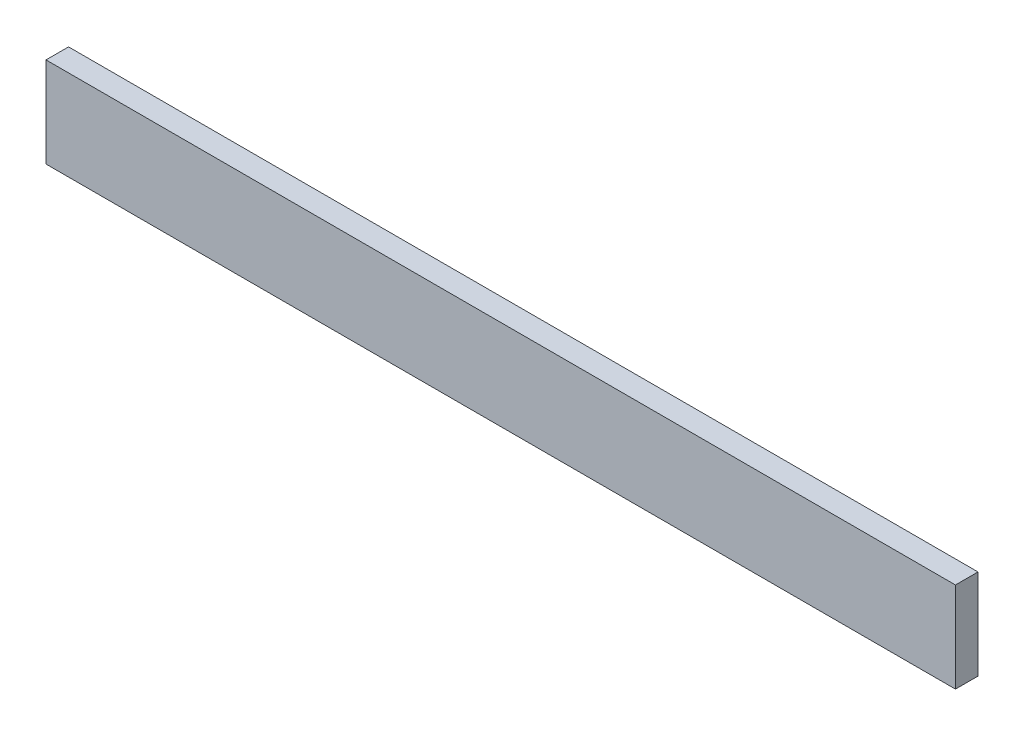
ISO-10303-21;
HEADER;
FILE_DESCRIPTION(('STEP AP214'),'2;1');
FILE_NAME('part.step','',(''),(''),'','','');
FILE_SCHEMA(('AUTOMOTIVE_DESIGN { 1 0 10303 214 1 1 1 1 }'));
ENDSEC;
DATA;
#1=APPLICATION_CONTEXT('core data for automotive mechanical design processes');
#2=APPLICATION_PROTOCOL_DEFINITION('international standard','automotive_design',2000,#1);
#3=PRODUCT_CONTEXT('',#1,'mechanical');
#4=PRODUCT('Part','Part','',(#3));
#5=PRODUCT_RELATED_PRODUCT_CATEGORY('part','',(#4));
#6=PRODUCT_DEFINITION_FORMATION('','',#4);
#7=PRODUCT_DEFINITION_CONTEXT('part definition',#1,'design');
#8=PRODUCT_DEFINITION('design','',#6,#7);
#9=PRODUCT_DEFINITION_SHAPE('','',#8);
#10=(LENGTH_UNIT() NAMED_UNIT(*) SI_UNIT(.MILLI.,.METRE.));
#11=(NAMED_UNIT(*) PLANE_ANGLE_UNIT() SI_UNIT($,.RADIAN.));
#12=(NAMED_UNIT(*) SI_UNIT($,.STERADIAN.) SOLID_ANGLE_UNIT());
#13=UNCERTAINTY_MEASURE_WITH_UNIT(LENGTH_MEASURE(1.E-05),#10,'distance_accuracy_value','');
#14=(GEOMETRIC_REPRESENTATION_CONTEXT(3) GLOBAL_UNCERTAINTY_ASSIGNED_CONTEXT((#13)) GLOBAL_UNIT_ASSIGNED_CONTEXT((#10,
#11,#12)) REPRESENTATION_CONTEXT('',''));
#15=CARTESIAN_POINT('',(0.,0.,0.));
#16=DIRECTION('',(0.,0.,1.));
#17=DIRECTION('',(1.,0.,0.));
#18=AXIS2_PLACEMENT_3D('',#15,#16,#17);
#19=CARTESIAN_POINT('',(252.,-25.,12.5));
#20=DIRECTION('',(-1.,0.,0.));
#21=DIRECTION('',(0.,0.,1.));
#22=AXIS2_PLACEMENT_3D('',#19,#20,#21);
#23=PLANE('',#22);
#24=DIRECTION('',(0.,1.,0.));
#25=VECTOR('',#24,1.);
#26=CARTESIAN_POINT('',(252.,-25.,0.));
#27=LINE('',#26,#25);
#28=CARTESIAN_POINT('',(252.,-25.,0.));
#29=VERTEX_POINT('',#28);
#30=CARTESIAN_POINT('',(252.,25.,0.));
#31=VERTEX_POINT('',#30);
#32=EDGE_CURVE('E97',#29,#31,#27,.T.);
#33=ORIENTED_EDGE('',*,*,#32,.T.);
#34=DIRECTION('',(0.,0.,-1.));
#35=VECTOR('',#34,1.);
#36=CARTESIAN_POINT('',(252.,25.,12.5));
#37=LINE('',#36,#35);
#38=CARTESIAN_POINT('',(252.,25.,12.5));
#39=VERTEX_POINT('',#38);
#40=EDGE_CURVE('E11',#39,#31,#37,.T.);
#41=ORIENTED_EDGE('',*,*,#40,.F.);
#42=DIRECTION('',(0.,1.,0.));
#43=VECTOR('',#42,1.);
#44=CARTESIAN_POINT('',(252.,-25.,12.5));
#45=LINE('',#44,#43);
#46=CARTESIAN_POINT('',(252.,-25.,12.5));
#47=VERTEX_POINT('',#46);
#48=EDGE_CURVE('E85',#47,#39,#45,.T.);
#49=ORIENTED_EDGE('',*,*,#48,.F.);
#50=DIRECTION('',(0.,0.,-1.));
#51=VECTOR('',#50,1.);
#52=CARTESIAN_POINT('',(252.,-25.,12.5));
#53=LINE('',#52,#51);
#54=EDGE_CURVE('E93',#47,#29,#53,.T.);
#55=ORIENTED_EDGE('',*,*,#54,.T.);
#56=EDGE_LOOP('',(#33,#41,#49,#55));
#57=FACE_BOUND('',#56,.T.);
#58=ADVANCED_FACE('F34',(#57),#23,.F.);
#59=CARTESIAN_POINT('',(-252.,25.,12.5));
#60=DIRECTION('',(0.,-1.,0.));
#61=DIRECTION('',(0.,0.,-1.));
#62=AXIS2_PLACEMENT_3D('',#59,#60,#61);
#63=PLANE('',#62);
#64=DIRECTION('',(-1.,0.,0.));
#65=VECTOR('',#64,1.);
#66=CARTESIAN_POINT('',(-252.,25.,0.));
#67=LINE('',#66,#65);
#68=CARTESIAN_POINT('',(-252.,25.,0.));
#69=VERTEX_POINT('',#68);
#70=EDGE_CURVE('E89',#31,#69,#67,.T.);
#71=ORIENTED_EDGE('',*,*,#70,.T.);
#72=DIRECTION('',(0.,0.,-1.));
#73=VECTOR('',#72,1.);
#74=CARTESIAN_POINT('',(-252.,25.,12.5));
#75=LINE('',#74,#73);
#76=CARTESIAN_POINT('',(-252.,25.,12.5));
#77=VERTEX_POINT('',#76);
#78=EDGE_CURVE('E42',#77,#69,#75,.T.);
#79=ORIENTED_EDGE('',*,*,#78,.F.);
#80=DIRECTION('',(-1.,0.,0.));
#81=VECTOR('',#80,1.);
#82=CARTESIAN_POINT('',(-252.,25.,12.5));
#83=LINE('',#82,#81);
#84=EDGE_CURVE('E80',#39,#77,#83,.T.);
#85=ORIENTED_EDGE('',*,*,#84,.F.);
#86=ORIENTED_EDGE('',*,*,#40,.T.);
#87=EDGE_LOOP('',(#71,#79,#85,#86));
#88=FACE_BOUND('',#87,.T.);
#89=ADVANCED_FACE('F88',(#88),#63,.F.);
#90=CARTESIAN_POINT('',(-252.,-25.,12.5));
#91=DIRECTION('',(1.,0.,0.));
#92=DIRECTION('',(0.,0.,-1.));
#93=AXIS2_PLACEMENT_3D('',#90,#91,#92);
#94=PLANE('',#93);
#95=DIRECTION('',(0.,-1.,0.));
#96=VECTOR('',#95,1.);
#97=CARTESIAN_POINT('',(-252.,-25.,0.));
#98=LINE('',#97,#96);
#99=CARTESIAN_POINT('',(-252.,-25.,0.));
#100=VERTEX_POINT('',#99);
#101=EDGE_CURVE('E67',#69,#100,#98,.T.);
#102=ORIENTED_EDGE('',*,*,#101,.T.);
#103=DIRECTION('',(0.,0.,-1.));
#104=VECTOR('',#103,1.);
#105=CARTESIAN_POINT('',(-252.,-25.,12.5));
#106=LINE('',#105,#104);
#107=CARTESIAN_POINT('',(-252.,-25.,12.5));
#108=VERTEX_POINT('',#107);
#109=EDGE_CURVE('E90',#108,#100,#106,.T.);
#110=ORIENTED_EDGE('',*,*,#109,.F.);
#111=DIRECTION('',(0.,-1.,0.));
#112=VECTOR('',#111,1.);
#113=CARTESIAN_POINT('',(-252.,-25.,12.5));
#114=LINE('',#113,#112);
#115=EDGE_CURVE('E83',#77,#108,#114,.T.);
#116=ORIENTED_EDGE('',*,*,#115,.F.);
#117=ORIENTED_EDGE('',*,*,#78,.T.);
#118=EDGE_LOOP('',(#102,#110,#116,#117));
#119=FACE_BOUND('',#118,.T.);
#120=ADVANCED_FACE('F91',(#119),#94,.F.);
#121=CARTESIAN_POINT('',(-252.,-25.,12.5));
#122=DIRECTION('',(0.,1.,0.));
#123=DIRECTION('',(0.,0.,1.));
#124=AXIS2_PLACEMENT_3D('',#121,#122,#123);
#125=PLANE('',#124);
#126=DIRECTION('',(1.,0.,0.));
#127=VECTOR('',#126,1.);
#128=CARTESIAN_POINT('',(-252.,-25.,0.));
#129=LINE('',#128,#127);
#130=EDGE_CURVE('E73',#100,#29,#129,.T.);
#131=ORIENTED_EDGE('',*,*,#130,.T.);
#132=ORIENTED_EDGE('',*,*,#54,.F.);
#133=DIRECTION('',(1.,0.,0.));
#134=VECTOR('',#133,1.);
#135=CARTESIAN_POINT('',(-252.,-25.,12.5));
#136=LINE('',#135,#134);
#137=EDGE_CURVE('E50',#108,#47,#136,.T.);
#138=ORIENTED_EDGE('',*,*,#137,.F.);
#139=ORIENTED_EDGE('',*,*,#109,.T.);
#140=EDGE_LOOP('',(#131,#132,#138,#139));
#141=FACE_BOUND('',#140,.T.);
#142=ADVANCED_FACE('F104',(#141),#125,.F.);
#143=CARTESIAN_POINT('',(0.,0.,12.5));
#144=DIRECTION('',(0.,0.,-1.));
#145=DIRECTION('',(-1.,0.,0.));
#146=AXIS2_PLACEMENT_3D('',#143,#144,#145);
#147=PLANE('',#146);
#148=ORIENTED_EDGE('',*,*,#48,.T.);
#149=ORIENTED_EDGE('',*,*,#84,.T.);
#150=ORIENTED_EDGE('',*,*,#115,.T.);
#151=ORIENTED_EDGE('',*,*,#137,.T.);
#152=EDGE_LOOP('',(#148,#149,#150,#151));
#153=FACE_BOUND('',#152,.T.);
#154=ADVANCED_FACE('F81',(#153),#147,.F.);
#155=CARTESIAN_POINT('',(0.,0.,0.));
#156=DIRECTION('',(0.,0.,-1.));
#157=DIRECTION('',(-1.,0.,0.));
#158=AXIS2_PLACEMENT_3D('',#155,#156,#157);
#159=PLANE('',#158);
#160=ORIENTED_EDGE('',*,*,#32,.F.);
#161=ORIENTED_EDGE('',*,*,#130,.F.);
#162=ORIENTED_EDGE('',*,*,#101,.F.);
#163=ORIENTED_EDGE('',*,*,#70,.F.);
#164=EDGE_LOOP('',(#160,#161,#162,#163));
#165=FACE_BOUND('',#164,.T.);
#166=ADVANCED_FACE('F107',(#165),#159,.T.);
#167=CLOSED_SHELL('',(#58,#89,#120,#142,#154,#166));
#168=MANIFOLD_SOLID_BREP('B2',#167);
#169=ADVANCED_BREP_SHAPE_REPRESENTATION('',(#18,#168),#14);
#170=SHAPE_DEFINITION_REPRESENTATION(#9,#169);
ENDSEC;
END-ISO-10303-21;
